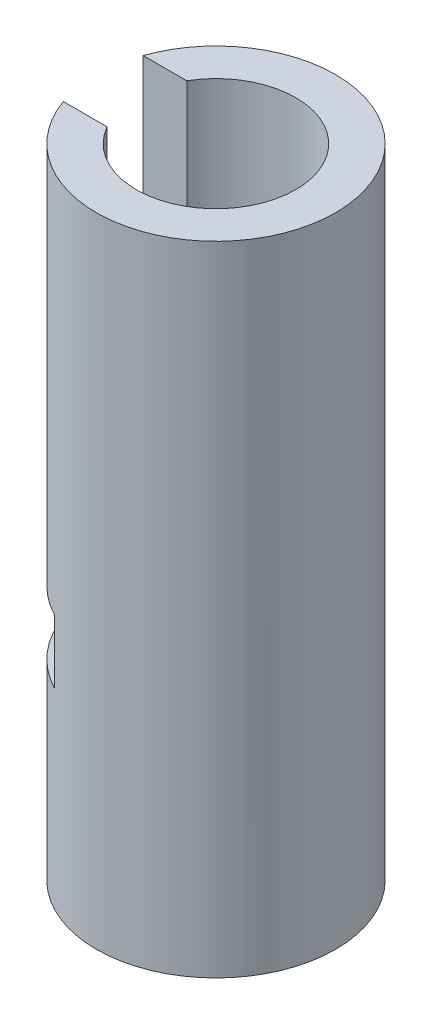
from build123d import *

# Parameters (mm, degrees)
SKETCH1_R           = 9.525
BOSS_EXTRUDE1_DEPTH = 50.8
SKETCH2_R           = 4.445
CUT_EXTRUDE1_DEPTH  = 44.45
SKETCH3_R           = 6.35
CUT_EXTRUDE2_DEPTH  = 25.4
SKETCH4_W           = 17.138949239
SKETCH4_H           = 6.35
CUT_EXTRUDE3_DEPTH  = 35.56
SKETCH5_W           = 9.525
SKETCH5_H           = 5.08
CUT_REVOLVE2_ANGLE  = 50
SKETCH6_W           = 9.525
SKETCH6_H           = 5.08
CUT_REVOLVE6_ANGLE  = 50


with BuildPart() as part:
    # Sketch1 → Boss-Extrude1 (new body)
    with BuildSketch(Plane(origin=(0, 0, 0), x_dir=(1, 0, 0), z_dir=(0, 1, 0))):
        with Locations(Location((-32.312382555, 17.84415156, 0), (0, 0, 270))):
            Circle(SKETCH1_R)
    extrude(amount=BOSS_EXTRUDE1_DEPTH)

    # Sketch2 → Cut-Extrude1 (cut)
    with BuildSketch(Plane(origin=(0, 50.8, 0), x_dir=(1, 0, 0), z_dir=(0, 1, 0))):
        with Locations(Location((-32.312382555, 17.84415156, 0), (0, 0, 270))):
            Circle(SKETCH2_R)
    extrude(amount=-CUT_EXTRUDE1_DEPTH, mode=Mode.SUBTRACT)

    # Sketch3 → Cut-Extrude2 (cut)
    with BuildSketch(Plane(origin=(0, 50.8, 0), x_dir=(1, 0, 0), z_dir=(0, 1, 0))):
        with Locations(Location((-32.312382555, 17.84415156, 0), (0, 0, 270))):
            Circle(SKETCH3_R)
    extrude(amount=-CUT_EXTRUDE2_DEPTH, mode=Mode.SUBTRACT)

    # Sketch4 → Cut-Extrude3 (cut)
    with BuildSketch(Plane(origin=(0, 50.8, 0), x_dir=(1, 0, 0), z_dir=(0, 1, 0))):
        with Locations((-40.881857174, 17.84415156)):
            Rectangle(SKETCH4_W, SKETCH4_H)
    extrude(amount=-CUT_EXTRUDE3_DEPTH, mode=Mode.SUBTRACT)

    # Sketch5 → Cut-Revolve2 (revolve, cut)
    with BuildSketch(Plane(origin=(0, 0, -14.66915156), x_dir=(-1, 0, 0), z_dir=(0, 0, -1))):
        with Locations((37.074882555, 17.78)):
            Rectangle(SKETCH5_W, SKETCH5_H)
    revolve(axis=Axis((-32.312382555, 15.24, -14.66915156), (0, 1, 0)), revolution_arc=CUT_REVOLVE2_ANGLE, mode=Mode.SUBTRACT)

    # Sketch6 → Cut-Revolve6 (revolve, cut)
    with BuildSketch(Plane.XY.offset(-21.01915156)):
        with Locations((-37.074882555, 17.78)):
            Rectangle(SKETCH6_W, SKETCH6_H)
    revolve(axis=Axis((-32.312382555, 15.24, -21.01915156), (0, -1, 0)), revolution_arc=CUT_REVOLVE6_ANGLE, mode=Mode.SUBTRACT)


solid = part.part
